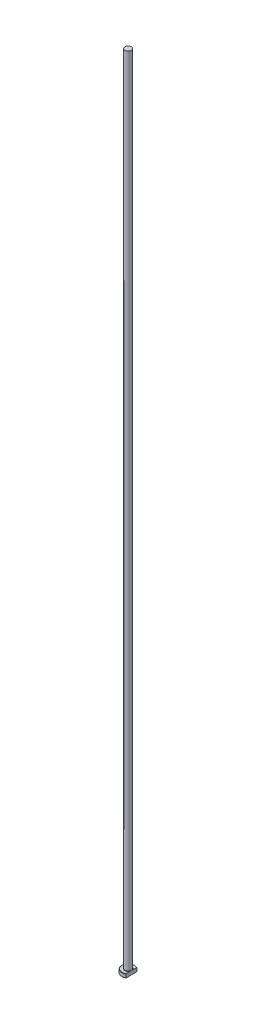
from build123d import *
from build123d.topology import SkipClean

# Parameters (mm, degrees)
CHAMFER1_SIZE = 0.2
FILLET1_R     = 0.2
KEY_DEPTH     = 631.03968129


with BuildPart() as part:
    # Sketch1 → Revolve1 (revolve)
    with BuildSketch(Plane.XY, mode=Mode.PRIVATE) as revolve1_sk:
        Polygon((0, 0), (-5, 0), (-5, 3), (-2.5, 3), (-2.5, 630), (0, 630), align=None)
    revolve(revolve1_sk.sketch.rotate(Axis((0, 259.958771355, 0), (0, -1, 0)), 270), axis=Axis((0, 259.958771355, 0), (0, -1, 0)))

    # Chamfer1
    chamfer1_edges = [part.edges().sort_by_distance(p)[0] for p in [
        (0, 3, -5),
        (0, 0, -5),
    ]]
    chamfer(chamfer1_edges, length=CHAMFER1_SIZE)

    # Fillet1
    fillet1_edges = [part.edges().sort_by_distance(p)[0] for p in [
        (0, 3, -2.5),
    ]]
    fillet(fillet1_edges, radius=FILLET1_R)

    # Sketch2 → KEY (cut, through all)
    with SkipClean():  # the faces are left unmerged after this step: merging them gives an invalid solid
        with BuildSketch(Plane(origin=(0, 0, 0), x_dir=(1, 0, 0), z_dir=(0, 1, 0))):
            with BuildLine():
                Line((2.5, 4.330127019), (2.5, -4.330127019))
                ThreePointArc((2.5, -4.330127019), (5, 0), (2.5, 4.330127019))
            make_face()
        extrude(amount=KEY_DEPTH, mode=Mode.SUBTRACT)


solid = part.part
